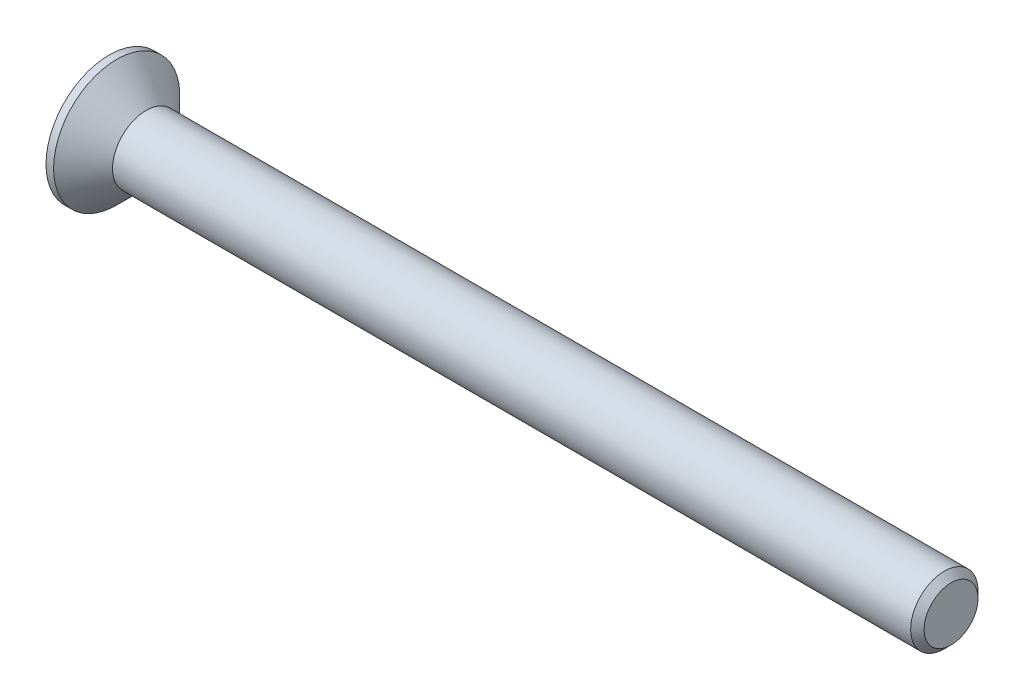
ISO-10303-21;
HEADER;
FILE_DESCRIPTION(('STEP AP214'),'2;1');
FILE_NAME('part.step','',(''),(''),'','','');
FILE_SCHEMA(('AUTOMOTIVE_DESIGN { 1 0 10303 214 1 1 1 1 }'));
ENDSEC;
DATA;
#1=APPLICATION_CONTEXT('core data for automotive mechanical design processes');
#2=APPLICATION_PROTOCOL_DEFINITION('international standard','automotive_design',2000,#1);
#3=PRODUCT_CONTEXT('',#1,'mechanical');
#4=PRODUCT('Part','Part','',(#3));
#5=PRODUCT_RELATED_PRODUCT_CATEGORY('part','',(#4));
#6=PRODUCT_DEFINITION_FORMATION('','',#4);
#7=PRODUCT_DEFINITION_CONTEXT('part definition',#1,'design');
#8=PRODUCT_DEFINITION('design','',#6,#7);
#9=PRODUCT_DEFINITION_SHAPE('','',#8);
#10=(LENGTH_UNIT() NAMED_UNIT(*) SI_UNIT(.MILLI.,.METRE.));
#11=(NAMED_UNIT(*) PLANE_ANGLE_UNIT() SI_UNIT($,.RADIAN.));
#12=(NAMED_UNIT(*) SI_UNIT($,.STERADIAN.) SOLID_ANGLE_UNIT());
#13=UNCERTAINTY_MEASURE_WITH_UNIT(LENGTH_MEASURE(1.E-05),#10,'distance_accuracy_value','');
#14=(GEOMETRIC_REPRESENTATION_CONTEXT(3) GLOBAL_UNCERTAINTY_ASSIGNED_CONTEXT((#13)) GLOBAL_UNIT_ASSIGNED_CONTEXT((#10,
#11,#12)) REPRESENTATION_CONTEXT('',''));
#15=CARTESIAN_POINT('',(0.,0.,0.));
#16=DIRECTION('',(0.,0.,1.));
#17=DIRECTION('',(1.,0.,0.));
#18=AXIS2_PLACEMENT_3D('',#15,#16,#17);
#19=CARTESIAN_POINT('',(0.,0.,0.));
#20=DIRECTION('',(-1.,0.,0.));
#21=DIRECTION('',(0.,0.,1.));
#22=AXIS2_PLACEMENT_3D('',#19,#20,#21);
#23=CONICAL_SURFACE('',#22,2.,0.78539816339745);
#24=CARTESIAN_POINT('',(-1.74999999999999,0.,0.));
#25=DIRECTION('',(-1.,0.,0.));
#26=DIRECTION('',(0.,0.,1.));
#27=AXIS2_PLACEMENT_3D('',#24,#25,#26);
#28=CIRCLE('',#27,3.75);
#29=CARTESIAN_POINT('',(-1.74999999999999,0.,3.75));
#30=VERTEX_POINT('',#29);
#31=EDGE_CURVE('E189',#30,#30,#28,.T.);
#32=ORIENTED_EDGE('',*,*,#31,.F.);
#33=EDGE_LOOP('',(#32));
#34=FACE_BOUND('',#33,.T.);
#35=CARTESIAN_POINT('',(0.,0.,0.));
#36=DIRECTION('',(-1.,0.,0.));
#37=DIRECTION('',(0.,0.,1.));
#38=AXIS2_PLACEMENT_3D('',#35,#36,#37);
#39=CIRCLE('',#38,2.);
#40=CARTESIAN_POINT('',(0.,0.,2.));
#41=VERTEX_POINT('',#40);
#42=EDGE_CURVE('E212',#41,#41,#39,.T.);
#43=ORIENTED_EDGE('',*,*,#42,.T.);
#44=EDGE_LOOP('',(#43));
#45=FACE_BOUND('',#44,.T.);
#46=ADVANCED_FACE('F33',(#34,#45),#23,.T.);
#47=CARTESIAN_POINT('',(-2.2,0.,0.));
#48=DIRECTION('',(-1.,0.,0.));
#49=DIRECTION('',(0.,0.,1.));
#50=AXIS2_PLACEMENT_3D('',#47,#48,#49);
#51=CYLINDRICAL_SURFACE('',#50,2.);
#52=CARTESIAN_POINT('',(47.4,0.,0.));
#53=DIRECTION('',(-1.,0.,0.));
#54=DIRECTION('',(0.,0.,1.));
#55=AXIS2_PLACEMENT_3D('',#52,#53,#54);
#56=CIRCLE('',#55,2.);
#57=CARTESIAN_POINT('',(47.4,0.,2.));
#58=VERTEX_POINT('',#57);
#59=EDGE_CURVE('E41',#58,#58,#56,.T.);
#60=ORIENTED_EDGE('',*,*,#59,.T.);
#61=EDGE_LOOP('',(#60));
#62=FACE_BOUND('',#61,.T.);
#63=ORIENTED_EDGE('',*,*,#42,.F.);
#64=EDGE_LOOP('',(#63));
#65=FACE_BOUND('',#64,.T.);
#66=ADVANCED_FACE('F217',(#62,#65),#51,.T.);
#67=CARTESIAN_POINT('',(47.8,0.,0.));
#68=DIRECTION('',(-1.,0.,0.));
#69=DIRECTION('',(0.,0.,1.));
#70=AXIS2_PLACEMENT_3D('',#67,#68,#69);
#71=PLANE('',#70);
#72=CARTESIAN_POINT('',(47.8,0.,0.));
#73=DIRECTION('',(-1.,0.,0.));
#74=DIRECTION('',(0.,0.,1.));
#75=AXIS2_PLACEMENT_3D('',#72,#73,#74);
#76=CIRCLE('',#75,1.6);
#77=CARTESIAN_POINT('',(47.8,0.,1.6));
#78=VERTEX_POINT('',#77);
#79=EDGE_CURVE('E11',#78,#78,#76,.F.);
#80=ORIENTED_EDGE('',*,*,#79,.T.);
#81=EDGE_LOOP('',(#80));
#82=FACE_BOUND('',#81,.T.);
#83=ADVANCED_FACE('F239',(#82),#71,.F.);
#84=CARTESIAN_POINT('',(-2.2,3.75,0.));
#85=DIRECTION('',(1.,0.,0.));
#86=DIRECTION('',(0.,0.,-1.));
#87=AXIS2_PLACEMENT_3D('',#84,#85,#86);
#88=PLANE('',#87);
#89=DIRECTION('',(0.,0.,-1.));
#90=VECTOR('',#89,1.);
#91=CARTESIAN_POINT('',(-2.2,0.55,-2.2));
#92=LINE('',#91,#90);
#93=CARTESIAN_POINT('',(-2.2,0.55,-0.55));
#94=VERTEX_POINT('',#93);
#95=CARTESIAN_POINT('',(-2.2,0.55,-2.2));
#96=VERTEX_POINT('',#95);
#97=EDGE_CURVE('E158',#94,#96,#92,.T.);
#98=ORIENTED_EDGE('',*,*,#97,.F.);
#99=DIRECTION('',(0.,-1.,0.));
#100=VECTOR('',#99,1.);
#101=CARTESIAN_POINT('',(-2.2,0.55,-0.55));
#102=LINE('',#101,#100);
#103=CARTESIAN_POINT('',(-2.2,2.2,-0.55));
#104=VERTEX_POINT('',#103);
#105=EDGE_CURVE('E48',#104,#94,#102,.T.);
#106=ORIENTED_EDGE('',*,*,#105,.F.);
#107=DIRECTION('',(0.,0.,-1.));
#108=VECTOR('',#107,1.);
#109=CARTESIAN_POINT('',(-2.2,2.2,-0.55));
#110=LINE('',#109,#108);
#111=CARTESIAN_POINT('',(-2.2,2.2,0.55));
#112=VERTEX_POINT('',#111);
#113=EDGE_CURVE('E185',#112,#104,#110,.T.);
#114=ORIENTED_EDGE('',*,*,#113,.F.);
#115=DIRECTION('',(0.,1.,0.));
#116=VECTOR('',#115,1.);
#117=CARTESIAN_POINT('',(-2.2,2.2,0.55));
#118=LINE('',#117,#116);
#119=CARTESIAN_POINT('',(-2.2,0.55,0.55));
#120=VERTEX_POINT('',#119);
#121=EDGE_CURVE('E183',#120,#112,#118,.T.);
#122=ORIENTED_EDGE('',*,*,#121,.F.);
#123=DIRECTION('',(0.,0.,-1.));
#124=VECTOR('',#123,1.);
#125=CARTESIAN_POINT('',(-2.2,0.55,0.55));
#126=LINE('',#125,#124);
#127=CARTESIAN_POINT('',(-2.2,0.55,2.2));
#128=VERTEX_POINT('',#127);
#129=EDGE_CURVE('E132',#128,#120,#126,.T.);
#130=ORIENTED_EDGE('',*,*,#129,.F.);
#131=DIRECTION('',(0.,1.,0.));
#132=VECTOR('',#131,1.);
#133=CARTESIAN_POINT('',(-2.2,0.55,2.2));
#134=LINE('',#133,#132);
#135=CARTESIAN_POINT('',(-2.2,-0.55,2.2));
#136=VERTEX_POINT('',#135);
#137=EDGE_CURVE('E179',#136,#128,#134,.T.);
#138=ORIENTED_EDGE('',*,*,#137,.F.);
#139=DIRECTION('',(0.,0.,1.));
#140=VECTOR('',#139,1.);
#141=CARTESIAN_POINT('',(-2.2,-0.55,2.2));
#142=LINE('',#141,#140);
#143=CARTESIAN_POINT('',(-2.2,-0.55,0.55));
#144=VERTEX_POINT('',#143);
#145=EDGE_CURVE('E176',#144,#136,#142,.T.);
#146=ORIENTED_EDGE('',*,*,#145,.F.);
#147=DIRECTION('',(0.,1.,0.));
#148=VECTOR('',#147,1.);
#149=CARTESIAN_POINT('',(-2.2,-0.55,0.55));
#150=LINE('',#149,#148);
#151=CARTESIAN_POINT('',(-2.2,-2.2,0.55));
#152=VERTEX_POINT('',#151);
#153=EDGE_CURVE('E173',#152,#144,#150,.T.);
#154=ORIENTED_EDGE('',*,*,#153,.F.);
#155=DIRECTION('',(0.,0.,1.));
#156=VECTOR('',#155,1.);
#157=CARTESIAN_POINT('',(-2.2,-2.2,0.55));
#158=LINE('',#157,#156);
#159=CARTESIAN_POINT('',(-2.2,-2.2,-0.55));
#160=VERTEX_POINT('',#159);
#161=EDGE_CURVE('E170',#160,#152,#158,.T.);
#162=ORIENTED_EDGE('',*,*,#161,.F.);
#163=DIRECTION('',(0.,-1.,0.));
#164=VECTOR('',#163,1.);
#165=CARTESIAN_POINT('',(-2.2,-2.2,-0.55));
#166=LINE('',#165,#164);
#167=CARTESIAN_POINT('',(-2.2,-0.55,-0.55));
#168=VERTEX_POINT('',#167);
#169=EDGE_CURVE('E167',#168,#160,#166,.T.);
#170=ORIENTED_EDGE('',*,*,#169,.F.);
#171=DIRECTION('',(0.,0.,1.));
#172=VECTOR('',#171,1.);
#173=CARTESIAN_POINT('',(-2.2,-0.55,-0.55));
#174=LINE('',#173,#172);
#175=CARTESIAN_POINT('',(-2.2,-0.55,-2.2));
#176=VERTEX_POINT('',#175);
#177=EDGE_CURVE('E164',#176,#168,#174,.T.);
#178=ORIENTED_EDGE('',*,*,#177,.F.);
#179=DIRECTION('',(0.,-1.,0.));
#180=VECTOR('',#179,1.);
#181=CARTESIAN_POINT('',(-2.2,-0.55,-2.2));
#182=LINE('',#181,#180);
#183=EDGE_CURVE('E161',#96,#176,#182,.T.);
#184=ORIENTED_EDGE('',*,*,#183,.F.);
#185=EDGE_LOOP('',(#98,#106,#114,#122,#130,#138,#146,#154,#162,#170,#178,#184));
#186=FACE_BOUND('',#185,.T.);
#187=CARTESIAN_POINT('',(-2.2,0.,0.));
#188=DIRECTION('',(-1.,0.,0.));
#189=DIRECTION('',(0.,0.,1.));
#190=AXIS2_PLACEMENT_3D('',#187,#188,#189);
#191=CIRCLE('',#190,3.75);
#192=CARTESIAN_POINT('',(-2.2,0.,3.75));
#193=VERTEX_POINT('',#192);
#194=EDGE_CURVE('E209',#193,#193,#191,.T.);
#195=ORIENTED_EDGE('',*,*,#194,.T.);
#196=EDGE_LOOP('',(#195));
#197=FACE_BOUND('',#196,.T.);
#198=ADVANCED_FACE('F230',(#186,#197),#88,.F.);
#199=CARTESIAN_POINT('',(-2.2,0.,0.));
#200=DIRECTION('',(-1.,0.,0.));
#201=DIRECTION('',(0.,0.,1.));
#202=AXIS2_PLACEMENT_3D('',#199,#200,#201);
#203=CYLINDRICAL_SURFACE('',#202,3.75);
#204=ORIENTED_EDGE('',*,*,#194,.F.);
#205=EDGE_LOOP('',(#204));
#206=FACE_BOUND('',#205,.T.);
#207=ORIENTED_EDGE('',*,*,#31,.T.);
#208=EDGE_LOOP('',(#207));
#209=FACE_BOUND('',#208,.T.);
#210=ADVANCED_FACE('F222',(#206,#209),#203,.T.);
#211=CARTESIAN_POINT('',(47.4,0.,0.));
#212=DIRECTION('',(-1.,0.,0.));
#213=DIRECTION('',(0.,0.,1.));
#214=AXIS2_PLACEMENT_3D('',#211,#212,#213);
#215=CONICAL_SURFACE('',#214,2.,0.785398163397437);
#216=ORIENTED_EDGE('',*,*,#79,.F.);
#217=EDGE_LOOP('',(#216));
#218=FACE_BOUND('',#217,.T.);
#219=ORIENTED_EDGE('',*,*,#59,.F.);
#220=EDGE_LOOP('',(#219));
#221=FACE_BOUND('',#220,.T.);
#222=ADVANCED_FACE('F35',(#218,#221),#215,.T.);
#223=CARTESIAN_POINT('',(-0.3,0.55,-0.55));
#224=DIRECTION('',(0.,0.,-1.));
#225=DIRECTION('',(-1.,0.,0.));
#226=AXIS2_PLACEMENT_3D('',#223,#224,#225);
#227=PLANE('',#226);
#228=ORIENTED_EDGE('',*,*,#105,.T.);
#229=DIRECTION('',(-1.,0.,0.));
#230=VECTOR('',#229,1.);
#231=CARTESIAN_POINT('',(-0.3,0.55,-0.55));
#232=LINE('',#231,#230);
#233=CARTESIAN_POINT('',(-0.3,0.55,-0.55));
#234=VERTEX_POINT('',#233);
#235=EDGE_CURVE('E96',#234,#94,#232,.T.);
#236=ORIENTED_EDGE('',*,*,#235,.F.);
#237=DIRECTION('',(0.,-1.,0.));
#238=VECTOR('',#237,1.);
#239=CARTESIAN_POINT('',(-0.3,0.55,-0.55));
#240=LINE('',#239,#238);
#241=CARTESIAN_POINT('',(-0.3,2.2,-0.55));
#242=VERTEX_POINT('',#241);
#243=EDGE_CURVE('E187',#242,#234,#240,.T.);
#244=ORIENTED_EDGE('',*,*,#243,.F.);
#245=DIRECTION('',(-1.,0.,0.));
#246=VECTOR('',#245,1.);
#247=CARTESIAN_POINT('',(-0.3,2.2,-0.55));
#248=LINE('',#247,#246);
#249=EDGE_CURVE('E56',#242,#104,#248,.T.);
#250=ORIENTED_EDGE('',*,*,#249,.T.);
#251=EDGE_LOOP('',(#228,#236,#244,#250));
#252=FACE_BOUND('',#251,.T.);
#253=ADVANCED_FACE('F221',(#252),#227,.F.);
#254=CARTESIAN_POINT('',(-0.3,2.2,-0.55));
#255=DIRECTION('',(0.,1.,0.));
#256=DIRECTION('',(-1.,0.,0.));
#257=AXIS2_PLACEMENT_3D('',#254,#255,#256);
#258=PLANE('',#257);
#259=ORIENTED_EDGE('',*,*,#113,.T.);
#260=ORIENTED_EDGE('',*,*,#249,.F.);
#261=DIRECTION('',(0.,0.,-1.));
#262=VECTOR('',#261,1.);
#263=CARTESIAN_POINT('',(-0.3,2.2,-0.55));
#264=LINE('',#263,#262);
#265=CARTESIAN_POINT('',(-0.3,2.2,0.55));
#266=VERTEX_POINT('',#265);
#267=EDGE_CURVE('E144',#266,#242,#264,.T.);
#268=ORIENTED_EDGE('',*,*,#267,.F.);
#269=DIRECTION('',(-1.,0.,0.));
#270=VECTOR('',#269,1.);
#271=CARTESIAN_POINT('',(-0.3,2.2,0.55));
#272=LINE('',#271,#270);
#273=EDGE_CURVE('E136',#266,#112,#272,.T.);
#274=ORIENTED_EDGE('',*,*,#273,.T.);
#275=EDGE_LOOP('',(#259,#260,#268,#274));
#276=FACE_BOUND('',#275,.T.);
#277=ADVANCED_FACE('F228',(#276),#258,.F.);
#278=CARTESIAN_POINT('',(-0.3,2.2,0.55));
#279=DIRECTION('',(0.,0.,1.));
#280=DIRECTION('',(1.,0.,0.));
#281=AXIS2_PLACEMENT_3D('',#278,#279,#280);
#282=PLANE('',#281);
#283=ORIENTED_EDGE('',*,*,#121,.T.);
#284=ORIENTED_EDGE('',*,*,#273,.F.);
#285=DIRECTION('',(0.,1.,0.));
#286=VECTOR('',#285,1.);
#287=CARTESIAN_POINT('',(-0.3,2.2,0.55));
#288=LINE('',#287,#286);
#289=CARTESIAN_POINT('',(-0.3,0.55,0.55));
#290=VERTEX_POINT('',#289);
#291=EDGE_CURVE('E140',#290,#266,#288,.T.);
#292=ORIENTED_EDGE('',*,*,#291,.F.);
#293=DIRECTION('',(-1.,0.,0.));
#294=VECTOR('',#293,1.);
#295=CARTESIAN_POINT('',(-0.3,0.55,0.55));
#296=LINE('',#295,#294);
#297=EDGE_CURVE('E125',#290,#120,#296,.T.);
#298=ORIENTED_EDGE('',*,*,#297,.T.);
#299=EDGE_LOOP('',(#283,#284,#292,#298));
#300=FACE_BOUND('',#299,.T.);
#301=ADVANCED_FACE('F141',(#300),#282,.F.);
#302=CARTESIAN_POINT('',(-0.3,0.55,0.55));
#303=DIRECTION('',(0.,1.,0.));
#304=DIRECTION('',(-1.,0.,0.));
#305=AXIS2_PLACEMENT_3D('',#302,#303,#304);
#306=PLANE('',#305);
#307=ORIENTED_EDGE('',*,*,#129,.T.);
#308=ORIENTED_EDGE('',*,*,#297,.F.);
#309=DIRECTION('',(0.,0.,-1.));
#310=VECTOR('',#309,1.);
#311=CARTESIAN_POINT('',(-0.3,0.55,0.55));
#312=LINE('',#311,#310);
#313=CARTESIAN_POINT('',(-0.3,0.55,2.2));
#314=VERTEX_POINT('',#313);
#315=EDGE_CURVE('E129',#314,#290,#312,.T.);
#316=ORIENTED_EDGE('',*,*,#315,.F.);
#317=DIRECTION('',(-1.,0.,0.));
#318=VECTOR('',#317,1.);
#319=CARTESIAN_POINT('',(-0.3,0.55,2.2));
#320=LINE('',#319,#318);
#321=EDGE_CURVE('E137',#314,#128,#320,.T.);
#322=ORIENTED_EDGE('',*,*,#321,.T.);
#323=EDGE_LOOP('',(#307,#308,#316,#322));
#324=FACE_BOUND('',#323,.T.);
#325=ADVANCED_FACE('F127',(#324),#306,.F.);
#326=CARTESIAN_POINT('',(-0.3,0.55,2.2));
#327=DIRECTION('',(0.,0.,1.));
#328=DIRECTION('',(1.,0.,0.));
#329=AXIS2_PLACEMENT_3D('',#326,#327,#328);
#330=PLANE('',#329);
#331=ORIENTED_EDGE('',*,*,#137,.T.);
#332=ORIENTED_EDGE('',*,*,#321,.F.);
#333=DIRECTION('',(0.,1.,0.));
#334=VECTOR('',#333,1.);
#335=CARTESIAN_POINT('',(-0.3,0.55,2.2));
#336=LINE('',#335,#334);
#337=CARTESIAN_POINT('',(-0.3,-0.55,2.2));
#338=VERTEX_POINT('',#337);
#339=EDGE_CURVE('E150',#338,#314,#336,.T.);
#340=ORIENTED_EDGE('',*,*,#339,.F.);
#341=DIRECTION('',(-1.,0.,0.));
#342=VECTOR('',#341,1.);
#343=CARTESIAN_POINT('',(-0.3,-0.55,2.2));
#344=LINE('',#343,#342);
#345=EDGE_CURVE('E192',#338,#136,#344,.T.);
#346=ORIENTED_EDGE('',*,*,#345,.T.);
#347=EDGE_LOOP('',(#331,#332,#340,#346));
#348=FACE_BOUND('',#347,.T.);
#349=ADVANCED_FACE('F277',(#348),#330,.F.);
#350=CARTESIAN_POINT('',(-0.3,-0.55,2.2));
#351=DIRECTION('',(0.,-1.,0.));
#352=DIRECTION('',(1.,0.,0.));
#353=AXIS2_PLACEMENT_3D('',#350,#351,#352);
#354=PLANE('',#353);
#355=ORIENTED_EDGE('',*,*,#145,.T.);
#356=ORIENTED_EDGE('',*,*,#345,.F.);
#357=DIRECTION('',(0.,0.,1.));
#358=VECTOR('',#357,1.);
#359=CARTESIAN_POINT('',(-0.3,-0.55,2.2));
#360=LINE('',#359,#358);
#361=CARTESIAN_POINT('',(-0.3,-0.55,0.55));
#362=VERTEX_POINT('',#361);
#363=EDGE_CURVE('E152',#362,#338,#360,.T.);
#364=ORIENTED_EDGE('',*,*,#363,.F.);
#365=DIRECTION('',(-1.,0.,0.));
#366=VECTOR('',#365,1.);
#367=CARTESIAN_POINT('',(-0.3,-0.55,0.55));
#368=LINE('',#367,#366);
#369=EDGE_CURVE('E194',#362,#144,#368,.T.);
#370=ORIENTED_EDGE('',*,*,#369,.T.);
#371=EDGE_LOOP('',(#355,#356,#364,#370));
#372=FACE_BOUND('',#371,.T.);
#373=ADVANCED_FACE('F273',(#372),#354,.F.);
#374=CARTESIAN_POINT('',(-0.3,-0.55,0.55));
#375=DIRECTION('',(0.,0.,1.));
#376=DIRECTION('',(1.,0.,0.));
#377=AXIS2_PLACEMENT_3D('',#374,#375,#376);
#378=PLANE('',#377);
#379=ORIENTED_EDGE('',*,*,#153,.T.);
#380=ORIENTED_EDGE('',*,*,#369,.F.);
#381=DIRECTION('',(0.,1.,0.));
#382=VECTOR('',#381,1.);
#383=CARTESIAN_POINT('',(-0.3,-0.55,0.55));
#384=LINE('',#383,#382);
#385=CARTESIAN_POINT('',(-0.3,-2.2,0.55));
#386=VERTEX_POINT('',#385);
#387=EDGE_CURVE('E422',#386,#362,#384,.T.);
#388=ORIENTED_EDGE('',*,*,#387,.F.);
#389=DIRECTION('',(-1.,0.,0.));
#390=VECTOR('',#389,1.);
#391=CARTESIAN_POINT('',(-0.3,-2.2,0.55));
#392=LINE('',#391,#390);
#393=EDGE_CURVE('E196',#386,#152,#392,.T.);
#394=ORIENTED_EDGE('',*,*,#393,.T.);
#395=EDGE_LOOP('',(#379,#380,#388,#394));
#396=FACE_BOUND('',#395,.T.);
#397=ADVANCED_FACE('F269',(#396),#378,.F.);
#398=CARTESIAN_POINT('',(-0.3,-2.2,0.55));
#399=DIRECTION('',(0.,-1.,0.));
#400=DIRECTION('',(1.,0.,0.));
#401=AXIS2_PLACEMENT_3D('',#398,#399,#400);
#402=PLANE('',#401);
#403=ORIENTED_EDGE('',*,*,#161,.T.);
#404=ORIENTED_EDGE('',*,*,#393,.F.);
#405=DIRECTION('',(0.,0.,1.));
#406=VECTOR('',#405,1.);
#407=CARTESIAN_POINT('',(-0.3,-2.2,0.55));
#408=LINE('',#407,#406);
#409=CARTESIAN_POINT('',(-0.3,-2.2,-0.55));
#410=VERTEX_POINT('',#409);
#411=EDGE_CURVE('E419',#410,#386,#408,.T.);
#412=ORIENTED_EDGE('',*,*,#411,.F.);
#413=DIRECTION('',(-1.,0.,0.));
#414=VECTOR('',#413,1.);
#415=CARTESIAN_POINT('',(-0.3,-2.2,-0.55));
#416=LINE('',#415,#414);
#417=EDGE_CURVE('E198',#410,#160,#416,.T.);
#418=ORIENTED_EDGE('',*,*,#417,.T.);
#419=EDGE_LOOP('',(#403,#404,#412,#418));
#420=FACE_BOUND('',#419,.T.);
#421=ADVANCED_FACE('F265',(#420),#402,.F.);
#422=CARTESIAN_POINT('',(-0.3,-2.2,-0.55));
#423=DIRECTION('',(0.,0.,-1.));
#424=DIRECTION('',(-1.,0.,0.));
#425=AXIS2_PLACEMENT_3D('',#422,#423,#424);
#426=PLANE('',#425);
#427=ORIENTED_EDGE('',*,*,#169,.T.);
#428=ORIENTED_EDGE('',*,*,#417,.F.);
#429=DIRECTION('',(0.,-1.,0.));
#430=VECTOR('',#429,1.);
#431=CARTESIAN_POINT('',(-0.3,-2.2,-0.55));
#432=LINE('',#431,#430);
#433=CARTESIAN_POINT('',(-0.3,-0.55,-0.55));
#434=VERTEX_POINT('',#433);
#435=EDGE_CURVE('E416',#434,#410,#432,.T.);
#436=ORIENTED_EDGE('',*,*,#435,.F.);
#437=DIRECTION('',(-1.,0.,0.));
#438=VECTOR('',#437,1.);
#439=CARTESIAN_POINT('',(-0.3,-0.55,-0.55));
#440=LINE('',#439,#438);
#441=EDGE_CURVE('E200',#434,#168,#440,.T.);
#442=ORIENTED_EDGE('',*,*,#441,.T.);
#443=EDGE_LOOP('',(#427,#428,#436,#442));
#444=FACE_BOUND('',#443,.T.);
#445=ADVANCED_FACE('F261',(#444),#426,.F.);
#446=CARTESIAN_POINT('',(-0.3,-0.55,-0.55));
#447=DIRECTION('',(0.,-1.,0.));
#448=DIRECTION('',(1.,0.,0.));
#449=AXIS2_PLACEMENT_3D('',#446,#447,#448);
#450=PLANE('',#449);
#451=ORIENTED_EDGE('',*,*,#177,.T.);
#452=ORIENTED_EDGE('',*,*,#441,.F.);
#453=DIRECTION('',(0.,0.,1.));
#454=VECTOR('',#453,1.);
#455=CARTESIAN_POINT('',(-0.3,-0.55,-0.55));
#456=LINE('',#455,#454);
#457=CARTESIAN_POINT('',(-0.3,-0.55,-2.2));
#458=VERTEX_POINT('',#457);
#459=EDGE_CURVE('E413',#458,#434,#456,.T.);
#460=ORIENTED_EDGE('',*,*,#459,.F.);
#461=DIRECTION('',(-1.,0.,0.));
#462=VECTOR('',#461,1.);
#463=CARTESIAN_POINT('',(-0.3,-0.55,-2.2));
#464=LINE('',#463,#462);
#465=EDGE_CURVE('E202',#458,#176,#464,.T.);
#466=ORIENTED_EDGE('',*,*,#465,.T.);
#467=EDGE_LOOP('',(#451,#452,#460,#466));
#468=FACE_BOUND('',#467,.T.);
#469=ADVANCED_FACE('F257',(#468),#450,.F.);
#470=CARTESIAN_POINT('',(-0.3,-0.55,-2.2));
#471=DIRECTION('',(0.,0.,-1.));
#472=DIRECTION('',(-1.,0.,0.));
#473=AXIS2_PLACEMENT_3D('',#470,#471,#472);
#474=PLANE('',#473);
#475=ORIENTED_EDGE('',*,*,#183,.T.);
#476=ORIENTED_EDGE('',*,*,#465,.F.);
#477=DIRECTION('',(0.,-1.,0.));
#478=VECTOR('',#477,1.);
#479=CARTESIAN_POINT('',(-0.3,-0.55,-2.2));
#480=LINE('',#479,#478);
#481=CARTESIAN_POINT('',(-0.3,0.55,-2.2));
#482=VERTEX_POINT('',#481);
#483=EDGE_CURVE('E408',#482,#458,#480,.T.);
#484=ORIENTED_EDGE('',*,*,#483,.F.);
#485=DIRECTION('',(-1.,0.,0.));
#486=VECTOR('',#485,1.);
#487=CARTESIAN_POINT('',(-0.3,0.55,-2.2));
#488=LINE('',#487,#486);
#489=EDGE_CURVE('E204',#482,#96,#488,.T.);
#490=ORIENTED_EDGE('',*,*,#489,.T.);
#491=EDGE_LOOP('',(#475,#476,#484,#490));
#492=FACE_BOUND('',#491,.T.);
#493=ADVANCED_FACE('F253',(#492),#474,.F.);
#494=CARTESIAN_POINT('',(-0.3,0.55,-2.2));
#495=DIRECTION('',(0.,1.,0.));
#496=DIRECTION('',(-1.,0.,0.));
#497=AXIS2_PLACEMENT_3D('',#494,#495,#496);
#498=PLANE('',#497);
#499=ORIENTED_EDGE('',*,*,#97,.T.);
#500=ORIENTED_EDGE('',*,*,#489,.F.);
#501=DIRECTION('',(0.,0.,-1.));
#502=VECTOR('',#501,1.);
#503=CARTESIAN_POINT('',(-0.3,0.55,-2.2));
#504=LINE('',#503,#502);
#505=EDGE_CURVE('E406',#234,#482,#504,.T.);
#506=ORIENTED_EDGE('',*,*,#505,.F.);
#507=ORIENTED_EDGE('',*,*,#235,.T.);
#508=EDGE_LOOP('',(#499,#500,#506,#507));
#509=FACE_BOUND('',#508,.T.);
#510=ADVANCED_FACE('F250',(#509),#498,.F.);
#511=CARTESIAN_POINT('',(-0.3,0.,0.));
#512=DIRECTION('',(1.,0.,0.));
#513=DIRECTION('',(0.,0.,-1.));
#514=AXIS2_PLACEMENT_3D('',#511,#512,#513);
#515=PLANE('',#514);
#516=ORIENTED_EDGE('',*,*,#243,.T.);
#517=ORIENTED_EDGE('',*,*,#505,.T.);
#518=ORIENTED_EDGE('',*,*,#483,.T.);
#519=ORIENTED_EDGE('',*,*,#459,.T.);
#520=ORIENTED_EDGE('',*,*,#435,.T.);
#521=ORIENTED_EDGE('',*,*,#411,.T.);
#522=ORIENTED_EDGE('',*,*,#387,.T.);
#523=ORIENTED_EDGE('',*,*,#363,.T.);
#524=ORIENTED_EDGE('',*,*,#339,.T.);
#525=ORIENTED_EDGE('',*,*,#315,.T.);
#526=ORIENTED_EDGE('',*,*,#291,.T.);
#527=ORIENTED_EDGE('',*,*,#267,.T.);
#528=EDGE_LOOP('',(#516,#517,#518,#519,#520,#521,#522,#523,#524,#525,#526,#527));
#529=FACE_BOUND('',#528,.T.);
#530=ADVANCED_FACE('F147',(#529),#515,.F.);
#531=CLOSED_SHELL('',(#46,#66,#83,#198,#210,#222,#253,#277,#301,#325,#349,#373,#397,#421,#445,
#469,#493,#510,#530));
#532=MANIFOLD_SOLID_BREP('B2',#531);
#533=ADVANCED_BREP_SHAPE_REPRESENTATION('',(#18,#532),#14);
#534=SHAPE_DEFINITION_REPRESENTATION(#9,#533);
ENDSEC;
END-ISO-10303-21;
